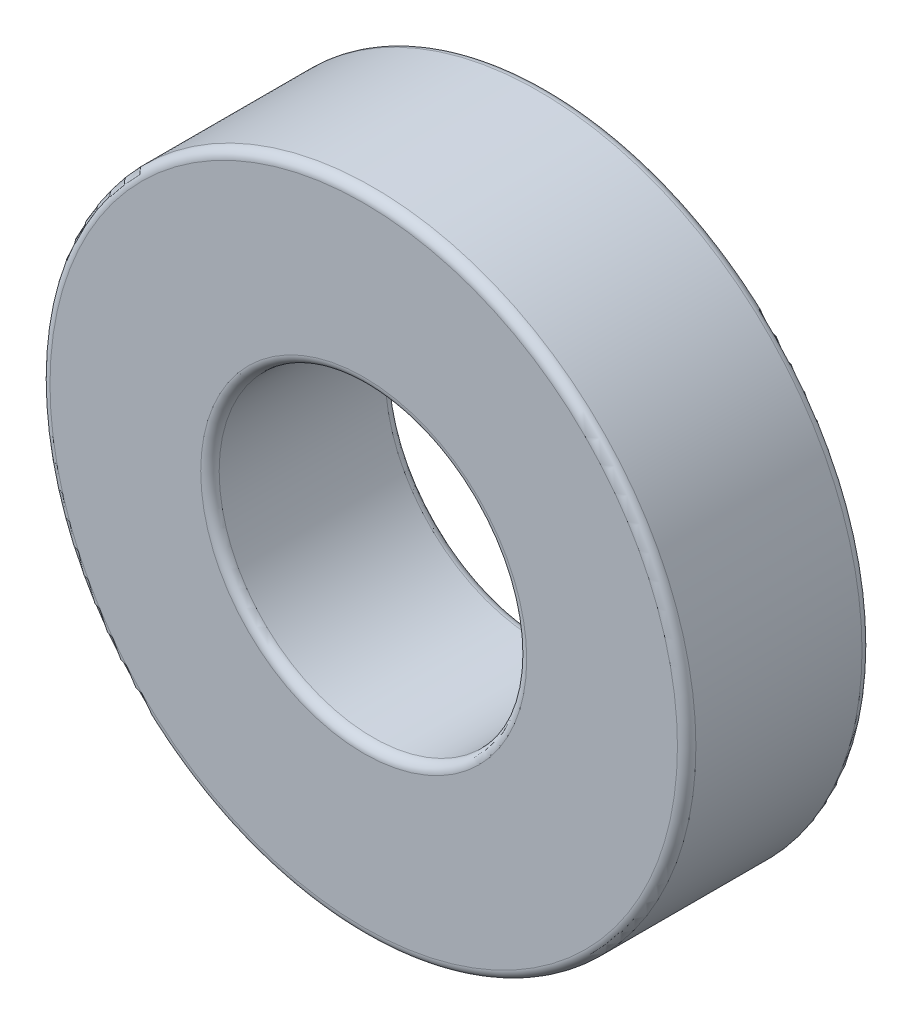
ISO-10303-21;
HEADER;
FILE_DESCRIPTION(('STEP AP214'),'2;1');
FILE_NAME('part.step','',(''),(''),'','','');
FILE_SCHEMA(('AUTOMOTIVE_DESIGN { 1 0 10303 214 1 1 1 1 }'));
ENDSEC;
DATA;
#1=APPLICATION_CONTEXT('core data for automotive mechanical design processes');
#2=APPLICATION_PROTOCOL_DEFINITION('international standard','automotive_design',2000,#1);
#3=PRODUCT_CONTEXT('',#1,'mechanical');
#4=PRODUCT('Part','Part','',(#3));
#5=PRODUCT_RELATED_PRODUCT_CATEGORY('part','',(#4));
#6=PRODUCT_DEFINITION_FORMATION('','',#4);
#7=PRODUCT_DEFINITION_CONTEXT('part definition',#1,'design');
#8=PRODUCT_DEFINITION('design','',#6,#7);
#9=PRODUCT_DEFINITION_SHAPE('','',#8);
#10=(LENGTH_UNIT() NAMED_UNIT(*) SI_UNIT(.MILLI.,.METRE.));
#11=(NAMED_UNIT(*) PLANE_ANGLE_UNIT() SI_UNIT($,.RADIAN.));
#12=(NAMED_UNIT(*) SI_UNIT($,.STERADIAN.) SOLID_ANGLE_UNIT());
#13=UNCERTAINTY_MEASURE_WITH_UNIT(LENGTH_MEASURE(1.E-05),#10,'distance_accuracy_value','');
#14=(GEOMETRIC_REPRESENTATION_CONTEXT(3) GLOBAL_UNCERTAINTY_ASSIGNED_CONTEXT((#13)) GLOBAL_UNIT_ASSIGNED_CONTEXT((#10,
#11,#12)) REPRESENTATION_CONTEXT('',''));
#15=CARTESIAN_POINT('',(0.,0.,0.));
#16=DIRECTION('',(0.,0.,1.));
#17=DIRECTION('',(1.,0.,0.));
#18=AXIS2_PLACEMENT_3D('',#15,#16,#17);
#19=CARTESIAN_POINT('',(0.,0.,-0.600000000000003));
#20=DIRECTION('',(0.,0.,1.));
#21=DIRECTION('',(1.,0.,0.));
#22=AXIS2_PLACEMENT_3D('',#19,#20,#21);
#23=TOROIDAL_SURFACE('',#22,20.4,0.599999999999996);
#24=CARTESIAN_POINT('',(0.,0.,-0.600000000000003));
#25=DIRECTION('',(0.,0.,1.));
#26=DIRECTION('',(1.,0.,0.));
#27=AXIS2_PLACEMENT_3D('',#24,#25,#26);
#28=CIRCLE('',#27,21.);
#29=CARTESIAN_POINT('',(21.,0.,-0.600000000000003));
#30=VERTEX_POINT('',#29);
#31=EDGE_CURVE('E10',#30,#30,#28,.T.);
#32=ORIENTED_EDGE('',*,*,#31,.T.);
#33=EDGE_LOOP('',(#32));
#34=FACE_BOUND('',#33,.T.);
#35=CARTESIAN_POINT('',(0.,0.,0.));
#36=DIRECTION('',(0.,0.,1.));
#37=DIRECTION('',(1.,0.,0.));
#38=AXIS2_PLACEMENT_3D('',#35,#36,#37);
#39=CIRCLE('',#38,20.4);
#40=CARTESIAN_POINT('',(20.4,0.,0.));
#41=VERTEX_POINT('',#40);
#42=EDGE_CURVE('E63',#41,#41,#39,.T.);
#43=ORIENTED_EDGE('',*,*,#42,.F.);
#44=EDGE_LOOP('',(#43));
#45=FACE_BOUND('',#44,.T.);
#46=ADVANCED_FACE('F35',(#34,#45),#23,.T.);
#47=CARTESIAN_POINT('',(0.,0.,33.1757165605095));
#48=DIRECTION('',(0.,0.,1.));
#49=DIRECTION('',(1.,0.,0.));
#50=AXIS2_PLACEMENT_3D('',#47,#48,#49);
#51=CYLINDRICAL_SURFACE('',#50,21.);
#52=CARTESIAN_POINT('',(0.,0.,-11.4));
#53=DIRECTION('',(0.,0.,1.));
#54=DIRECTION('',(1.,0.,0.));
#55=AXIS2_PLACEMENT_3D('',#52,#53,#54);
#56=CIRCLE('',#55,21.);
#57=CARTESIAN_POINT('',(21.,0.,-11.4));
#58=VERTEX_POINT('',#57);
#59=EDGE_CURVE('E41',#58,#58,#56,.T.);
#60=ORIENTED_EDGE('',*,*,#59,.T.);
#61=EDGE_LOOP('',(#60));
#62=FACE_BOUND('',#61,.T.);
#63=ORIENTED_EDGE('',*,*,#31,.F.);
#64=EDGE_LOOP('',(#63));
#65=FACE_BOUND('',#64,.T.);
#66=ADVANCED_FACE('F165',(#62,#65),#51,.T.);
#67=CARTESIAN_POINT('',(0.,0.,-11.4));
#68=DIRECTION('',(0.,0.,1.));
#69=DIRECTION('',(1.,0.,0.));
#70=AXIS2_PLACEMENT_3D('',#67,#68,#69);
#71=TOROIDAL_SURFACE('',#70,20.4,0.599999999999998);
#72=ORIENTED_EDGE('',*,*,#59,.F.);
#73=EDGE_LOOP('',(#72));
#74=FACE_BOUND('',#73,.T.);
#75=CARTESIAN_POINT('',(0.,0.,-12.));
#76=DIRECTION('',(0.,0.,1.));
#77=DIRECTION('',(1.,0.,0.));
#78=AXIS2_PLACEMENT_3D('',#75,#76,#77);
#79=CIRCLE('',#78,20.4);
#80=CARTESIAN_POINT('',(20.4,0.,-12.));
#81=VERTEX_POINT('',#80);
#82=EDGE_CURVE('E45',#81,#81,#79,.T.);
#83=ORIENTED_EDGE('',*,*,#82,.T.);
#84=EDGE_LOOP('',(#83));
#85=FACE_BOUND('',#84,.T.);
#86=ADVANCED_FACE('F162',(#74,#85),#71,.T.);
#87=CARTESIAN_POINT('',(0.,20.4,-12.));
#88=DIRECTION('',(0.,0.,-1.));
#89=DIRECTION('',(-1.,0.,0.));
#90=AXIS2_PLACEMENT_3D('',#87,#88,#89);
#91=PLANE('',#90);
#92=CARTESIAN_POINT('',(0.,0.,-12.));
#93=DIRECTION('',(0.,0.,1.));
#94=DIRECTION('',(1.,0.,0.));
#95=AXIS2_PLACEMENT_3D('',#92,#93,#94);
#96=CIRCLE('',#95,10.6);
#97=CARTESIAN_POINT('',(10.6,0.,-12.));
#98=VERTEX_POINT('',#97);
#99=EDGE_CURVE('E49',#98,#98,#96,.T.);
#100=ORIENTED_EDGE('',*,*,#99,.T.);
#101=EDGE_LOOP('',(#100));
#102=FACE_BOUND('',#101,.T.);
#103=ORIENTED_EDGE('',*,*,#82,.F.);
#104=EDGE_LOOP('',(#103));
#105=FACE_BOUND('',#104,.T.);
#106=ADVANCED_FACE('F158',(#102,#105),#91,.T.);
#107=CARTESIAN_POINT('',(0.,0.,-11.4));
#108=DIRECTION('',(0.,0.,1.));
#109=DIRECTION('',(1.,0.,0.));
#110=AXIS2_PLACEMENT_3D('',#107,#108,#109);
#111=TOROIDAL_SURFACE('',#110,10.6,0.600000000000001);
#112=CARTESIAN_POINT('',(0.,0.,-11.4));
#113=DIRECTION('',(0.,0.,1.));
#114=DIRECTION('',(1.,0.,0.));
#115=AXIS2_PLACEMENT_3D('',#112,#113,#114);
#116=CIRCLE('',#115,10.);
#117=CARTESIAN_POINT('',(10.,0.,-11.4));
#118=VERTEX_POINT('',#117);
#119=EDGE_CURVE('E54',#118,#118,#116,.T.);
#120=ORIENTED_EDGE('',*,*,#119,.T.);
#121=EDGE_LOOP('',(#120));
#122=FACE_BOUND('',#121,.T.);
#123=ORIENTED_EDGE('',*,*,#99,.F.);
#124=EDGE_LOOP('',(#123));
#125=FACE_BOUND('',#124,.T.);
#126=ADVANCED_FACE('F154',(#122,#125),#111,.T.);
#127=CARTESIAN_POINT('',(0.,0.,33.1757165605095));
#128=DIRECTION('',(0.,0.,1.));
#129=DIRECTION('',(1.,0.,0.));
#130=AXIS2_PLACEMENT_3D('',#127,#128,#129);
#131=CYLINDRICAL_SURFACE('',#130,10.);
#132=CARTESIAN_POINT('',(0.,0.,-0.600000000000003));
#133=DIRECTION('',(0.,0.,1.));
#134=DIRECTION('',(1.,0.,0.));
#135=AXIS2_PLACEMENT_3D('',#132,#133,#134);
#136=CIRCLE('',#135,10.);
#137=CARTESIAN_POINT('',(10.,0.,-0.600000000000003));
#138=VERTEX_POINT('',#137);
#139=EDGE_CURVE('E57',#138,#138,#136,.T.);
#140=ORIENTED_EDGE('',*,*,#139,.T.);
#141=EDGE_LOOP('',(#140));
#142=FACE_BOUND('',#141,.T.);
#143=ORIENTED_EDGE('',*,*,#119,.F.);
#144=EDGE_LOOP('',(#143));
#145=FACE_BOUND('',#144,.T.);
#146=ADVANCED_FACE('F150',(#142,#145),#131,.F.);
#147=CARTESIAN_POINT('',(0.,0.,-0.600000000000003));
#148=DIRECTION('',(0.,0.,1.));
#149=DIRECTION('',(1.,0.,0.));
#150=AXIS2_PLACEMENT_3D('',#147,#148,#149);
#151=TOROIDAL_SURFACE('',#150,10.6,0.600000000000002);
#152=CARTESIAN_POINT('',(0.,0.,0.));
#153=DIRECTION('',(0.,0.,1.));
#154=DIRECTION('',(1.,0.,0.));
#155=AXIS2_PLACEMENT_3D('',#152,#153,#154);
#156=CIRCLE('',#155,10.6);
#157=CARTESIAN_POINT('',(10.6,0.,0.));
#158=VERTEX_POINT('',#157);
#159=EDGE_CURVE('E60',#158,#158,#156,.T.);
#160=ORIENTED_EDGE('',*,*,#159,.T.);
#161=EDGE_LOOP('',(#160));
#162=FACE_BOUND('',#161,.T.);
#163=ORIENTED_EDGE('',*,*,#139,.F.);
#164=EDGE_LOOP('',(#163));
#165=FACE_BOUND('',#164,.T.);
#166=ADVANCED_FACE('F146',(#162,#165),#151,.T.);
#167=CARTESIAN_POINT('',(0.,10.6,0.));
#168=DIRECTION('',(0.,0.,1.));
#169=DIRECTION('',(1.,0.,0.));
#170=AXIS2_PLACEMENT_3D('',#167,#168,#169);
#171=PLANE('',#170);
#172=ORIENTED_EDGE('',*,*,#42,.T.);
#173=EDGE_LOOP('',(#172));
#174=FACE_BOUND('',#173,.T.);
#175=ORIENTED_EDGE('',*,*,#159,.F.);
#176=EDGE_LOOP('',(#175));
#177=FACE_BOUND('',#176,.T.);
#178=ADVANCED_FACE('F144',(#174,#177),#171,.T.);
#179=CLOSED_SHELL('',(#46,#66,#86,#106,#126,#146,#166,#178));
#180=CARTESIAN_POINT('',(0.,18.25,-5.985));
#181=DIRECTION('',(0.,0.,1.));
#182=DIRECTION('',(1.,0.,0.));
#183=AXIS2_PLACEMENT_3D('',#180,#181,#182);
#184=PLANE('',#183);
#185=CARTESIAN_POINT('',(0.,0.,-5.985));
#186=DIRECTION('',(0.,0.,1.));
#187=DIRECTION('',(1.,0.,0.));
#188=AXIS2_PLACEMENT_3D('',#185,#186,#187);
#189=CIRCLE('',#188,18.26);
#190=CARTESIAN_POINT('',(18.26,0.,-5.985));
#191=VERTEX_POINT('',#190);
#192=EDGE_CURVE('E66',#191,#191,#189,.T.);
#193=ORIENTED_EDGE('',*,*,#192,.F.);
#194=EDGE_LOOP('',(#193));
#195=FACE_BOUND('',#194,.T.);
#196=CARTESIAN_POINT('',(0.,0.,-5.985));
#197=DIRECTION('',(0.,0.,1.));
#198=DIRECTION('',(1.,0.,0.));
#199=AXIS2_PLACEMENT_3D('',#196,#197,#198);
#200=CIRCLE('',#199,15.515);
#201=CARTESIAN_POINT('',(15.515,0.,-5.985));
#202=VERTEX_POINT('',#201);
#203=EDGE_CURVE('E99',#202,#202,#200,.T.);
#204=ORIENTED_EDGE('',*,*,#203,.T.);
#205=EDGE_LOOP('',(#204));
#206=FACE_BOUND('',#205,.T.);
#207=ADVANCED_FACE('F103',(#195,#206),#184,.F.);
#208=CARTESIAN_POINT('',(0.,0.,8.31184503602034));
#209=DIRECTION('',(0.,0.,1.));
#210=DIRECTION('',(1.,0.,0.));
#211=AXIS2_PLACEMENT_3D('',#208,#209,#210);
#212=CYLINDRICAL_SURFACE('',#211,18.26);
#213=CARTESIAN_POINT('',(0.,0.,-6.01499999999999));
#214=DIRECTION('',(0.,0.,1.));
#215=DIRECTION('',(1.,0.,0.));
#216=AXIS2_PLACEMENT_3D('',#213,#214,#215);
#217=CIRCLE('',#216,18.26);
#218=CARTESIAN_POINT('',(18.26,0.,-6.01499999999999));
#219=VERTEX_POINT('',#218);
#220=EDGE_CURVE('E69',#219,#219,#217,.T.);
#221=ORIENTED_EDGE('',*,*,#220,.F.);
#222=EDGE_LOOP('',(#221));
#223=FACE_BOUND('',#222,.T.);
#224=ORIENTED_EDGE('',*,*,#192,.T.);
#225=EDGE_LOOP('',(#224));
#226=FACE_BOUND('',#225,.T.);
#227=ADVANCED_FACE('F131',(#223,#226),#212,.F.);
#228=CARTESIAN_POINT('',(0.,18.25,-6.01499999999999));
#229=DIRECTION('',(0.,0.,1.));
#230=DIRECTION('',(1.,0.,0.));
#231=AXIS2_PLACEMENT_3D('',#228,#229,#230);
#232=PLANE('',#231);
#233=ORIENTED_EDGE('',*,*,#220,.T.);
#234=EDGE_LOOP('',(#233));
#235=FACE_BOUND('',#234,.T.);
#236=CARTESIAN_POINT('',(0.,0.,-6.01499999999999));
#237=DIRECTION('',(0.,0.,1.));
#238=DIRECTION('',(1.,0.,0.));
#239=AXIS2_PLACEMENT_3D('',#236,#237,#238);
#240=CIRCLE('',#239,15.515);
#241=CARTESIAN_POINT('',(15.515,0.,-6.01499999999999));
#242=VERTEX_POINT('',#241);
#243=EDGE_CURVE('E72',#242,#242,#240,.T.);
#244=ORIENTED_EDGE('',*,*,#243,.F.);
#245=EDGE_LOOP('',(#244));
#246=FACE_BOUND('',#245,.T.);
#247=ADVANCED_FACE('F138',(#235,#246),#232,.T.);
#248=CARTESIAN_POINT('',(0.,0.,8.31184503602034));
#249=DIRECTION('',(0.,0.,1.));
#250=DIRECTION('',(1.,0.,0.));
#251=AXIS2_PLACEMENT_3D('',#248,#249,#250);
#252=CYLINDRICAL_SURFACE('',#251,15.515);
#253=ORIENTED_EDGE('',*,*,#243,.T.);
#254=EDGE_LOOP('',(#253));
#255=FACE_BOUND('',#254,.T.);
#256=CARTESIAN_POINT('',(0.,0.,-10.81));
#257=DIRECTION('',(0.,0.,1.));
#258=DIRECTION('',(1.,0.,0.));
#259=AXIS2_PLACEMENT_3D('',#256,#257,#258);
#260=CIRCLE('',#259,15.515);
#261=CARTESIAN_POINT('',(15.515,0.,-10.81));
#262=VERTEX_POINT('',#261);
#263=EDGE_CURVE('E75',#262,#262,#260,.T.);
#264=ORIENTED_EDGE('',*,*,#263,.F.);
#265=EDGE_LOOP('',(#264));
#266=FACE_BOUND('',#265,.T.);
#267=ADVANCED_FACE('F251',(#255,#266),#252,.F.);
#268=CARTESIAN_POINT('',(0.,18.25,-10.81));
#269=DIRECTION('',(0.,0.,1.));
#270=DIRECTION('',(1.,0.,0.));
#271=AXIS2_PLACEMENT_3D('',#268,#269,#270);
#272=PLANE('',#271);
#273=ORIENTED_EDGE('',*,*,#263,.T.);
#274=EDGE_LOOP('',(#273));
#275=FACE_BOUND('',#274,.T.);
#276=CARTESIAN_POINT('',(0.,0.,-10.81));
#277=DIRECTION('',(0.,0.,1.));
#278=DIRECTION('',(1.,0.,0.));
#279=AXIS2_PLACEMENT_3D('',#276,#277,#278);
#280=CIRCLE('',#279,15.485);
#281=CARTESIAN_POINT('',(15.485,0.,-10.81));
#282=VERTEX_POINT('',#281);
#283=EDGE_CURVE('E78',#282,#282,#280,.T.);
#284=ORIENTED_EDGE('',*,*,#283,.F.);
#285=EDGE_LOOP('',(#284));
#286=FACE_BOUND('',#285,.T.);
#287=ADVANCED_FACE('F260',(#275,#286),#272,.T.);
#288=CARTESIAN_POINT('',(0.,0.,8.31184503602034));
#289=DIRECTION('',(0.,0.,1.));
#290=DIRECTION('',(1.,0.,0.));
#291=AXIS2_PLACEMENT_3D('',#288,#289,#290);
#292=CYLINDRICAL_SURFACE('',#291,15.485);
#293=CARTESIAN_POINT('',(0.,0.,-6.01499999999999));
#294=DIRECTION('',(0.,0.,1.));
#295=DIRECTION('',(1.,0.,0.));
#296=AXIS2_PLACEMENT_3D('',#293,#294,#295);
#297=CIRCLE('',#296,15.485);
#298=CARTESIAN_POINT('',(15.485,0.,-6.01499999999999));
#299=VERTEX_POINT('',#298);
#300=EDGE_CURVE('E81',#299,#299,#297,.T.);
#301=ORIENTED_EDGE('',*,*,#300,.F.);
#302=EDGE_LOOP('',(#301));
#303=FACE_BOUND('',#302,.T.);
#304=ORIENTED_EDGE('',*,*,#283,.T.);
#305=EDGE_LOOP('',(#304));
#306=FACE_BOUND('',#305,.T.);
#307=ADVANCED_FACE('F270',(#303,#306),#292,.T.);
#308=CARTESIAN_POINT('',(0.,18.25,-6.01499999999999));
#309=DIRECTION('',(0.,0.,-1.));
#310=DIRECTION('',(-1.,0.,0.));
#311=AXIS2_PLACEMENT_3D('',#308,#309,#310);
#312=PLANE('',#311);
#313=CARTESIAN_POINT('',(0.,0.,-6.01499999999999));
#314=DIRECTION('',(0.,0.,1.));
#315=DIRECTION('',(1.,0.,0.));
#316=AXIS2_PLACEMENT_3D('',#313,#314,#315);
#317=CIRCLE('',#316,12.74);
#318=CARTESIAN_POINT('',(12.74,0.,-6.01499999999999));
#319=VERTEX_POINT('',#318);
#320=EDGE_CURVE('E84',#319,#319,#317,.T.);
#321=ORIENTED_EDGE('',*,*,#320,.F.);
#322=EDGE_LOOP('',(#321));
#323=FACE_BOUND('',#322,.T.);
#324=ORIENTED_EDGE('',*,*,#300,.T.);
#325=EDGE_LOOP('',(#324));
#326=FACE_BOUND('',#325,.T.);
#327=ADVANCED_FACE('F280',(#323,#326),#312,.F.);
#328=CARTESIAN_POINT('',(0.,0.,8.31184503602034));
#329=DIRECTION('',(0.,0.,1.));
#330=DIRECTION('',(1.,0.,0.));
#331=AXIS2_PLACEMENT_3D('',#328,#329,#330);
#332=CYLINDRICAL_SURFACE('',#331,12.74);
#333=ORIENTED_EDGE('',*,*,#320,.T.);
#334=EDGE_LOOP('',(#333));
#335=FACE_BOUND('',#334,.T.);
#336=CARTESIAN_POINT('',(0.,0.,-5.985));
#337=DIRECTION('',(0.,0.,1.));
#338=DIRECTION('',(1.,0.,0.));
#339=AXIS2_PLACEMENT_3D('',#336,#337,#338);
#340=CIRCLE('',#339,12.74);
#341=CARTESIAN_POINT('',(12.74,0.,-5.985));
#342=VERTEX_POINT('',#341);
#343=EDGE_CURVE('E87',#342,#342,#340,.T.);
#344=ORIENTED_EDGE('',*,*,#343,.F.);
#345=EDGE_LOOP('',(#344));
#346=FACE_BOUND('',#345,.T.);
#347=ADVANCED_FACE('F126',(#335,#346),#332,.T.);
#348=CARTESIAN_POINT('',(0.,18.25,-5.985));
#349=DIRECTION('',(0.,0.,-1.));
#350=DIRECTION('',(-1.,0.,0.));
#351=AXIS2_PLACEMENT_3D('',#348,#349,#350);
#352=PLANE('',#351);
#353=ORIENTED_EDGE('',*,*,#343,.T.);
#354=EDGE_LOOP('',(#353));
#355=FACE_BOUND('',#354,.T.);
#356=CARTESIAN_POINT('',(0.,0.,-5.985));
#357=DIRECTION('',(0.,0.,1.));
#358=DIRECTION('',(1.,0.,0.));
#359=AXIS2_PLACEMENT_3D('',#356,#357,#358);
#360=CIRCLE('',#359,15.485);
#361=CARTESIAN_POINT('',(15.485,0.,-5.985));
#362=VERTEX_POINT('',#361);
#363=EDGE_CURVE('E90',#362,#362,#360,.T.);
#364=ORIENTED_EDGE('',*,*,#363,.F.);
#365=EDGE_LOOP('',(#364));
#366=FACE_BOUND('',#365,.T.);
#367=ADVANCED_FACE('F120',(#355,#366),#352,.T.);
#368=CARTESIAN_POINT('',(0.,0.,8.31184503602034));
#369=DIRECTION('',(0.,0.,1.));
#370=DIRECTION('',(1.,0.,0.));
#371=AXIS2_PLACEMENT_3D('',#368,#369,#370);
#372=CYLINDRICAL_SURFACE('',#371,15.485);
#373=ORIENTED_EDGE('',*,*,#363,.T.);
#374=EDGE_LOOP('',(#373));
#375=FACE_BOUND('',#374,.T.);
#376=CARTESIAN_POINT('',(0.,0.,-1.19));
#377=DIRECTION('',(0.,0.,1.));
#378=DIRECTION('',(1.,0.,0.));
#379=AXIS2_PLACEMENT_3D('',#376,#377,#378);
#380=CIRCLE('',#379,15.485);
#381=CARTESIAN_POINT('',(15.485,0.,-1.19));
#382=VERTEX_POINT('',#381);
#383=EDGE_CURVE('E93',#382,#382,#380,.T.);
#384=ORIENTED_EDGE('',*,*,#383,.F.);
#385=EDGE_LOOP('',(#384));
#386=FACE_BOUND('',#385,.T.);
#387=ADVANCED_FACE('F115',(#375,#386),#372,.T.);
#388=CARTESIAN_POINT('',(0.,18.25,-1.19));
#389=DIRECTION('',(0.,0.,1.));
#390=DIRECTION('',(1.,0.,0.));
#391=AXIS2_PLACEMENT_3D('',#388,#389,#390);
#392=PLANE('',#391);
#393=CARTESIAN_POINT('',(0.,0.,-1.19));
#394=DIRECTION('',(0.,0.,1.));
#395=DIRECTION('',(1.,0.,0.));
#396=AXIS2_PLACEMENT_3D('',#393,#394,#395);
#397=CIRCLE('',#396,15.515);
#398=CARTESIAN_POINT('',(15.515,0.,-1.19));
#399=VERTEX_POINT('',#398);
#400=EDGE_CURVE('E96',#399,#399,#397,.T.);
#401=ORIENTED_EDGE('',*,*,#400,.F.);
#402=EDGE_LOOP('',(#401));
#403=FACE_BOUND('',#402,.T.);
#404=ORIENTED_EDGE('',*,*,#383,.T.);
#405=EDGE_LOOP('',(#404));
#406=FACE_BOUND('',#405,.T.);
#407=ADVANCED_FACE('F108',(#403,#406),#392,.F.);
#408=CARTESIAN_POINT('',(0.,0.,8.31184503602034));
#409=DIRECTION('',(0.,0.,1.));
#410=DIRECTION('',(1.,0.,0.));
#411=AXIS2_PLACEMENT_3D('',#408,#409,#410);
#412=CYLINDRICAL_SURFACE('',#411,15.515);
#413=ORIENTED_EDGE('',*,*,#203,.F.);
#414=EDGE_LOOP('',(#413));
#415=FACE_BOUND('',#414,.T.);
#416=ORIENTED_EDGE('',*,*,#400,.T.);
#417=EDGE_LOOP('',(#416));
#418=FACE_BOUND('',#417,.T.);
#419=ADVANCED_FACE('F105',(#415,#418),#412,.F.);
#420=CLOSED_SHELL('',(#207,#227,#247,#267,#287,#307,#327,#347,#367,#387,#407,#419));
#421=ORIENTED_CLOSED_SHELL('',*,#420,.T.);
#422=BREP_WITH_VOIDS('B2',#179,(#421));
#423=ADVANCED_BREP_SHAPE_REPRESENTATION('',(#18,#422),#14);
#424=SHAPE_DEFINITION_REPRESENTATION(#9,#423);
ENDSEC;
END-ISO-10303-21;
